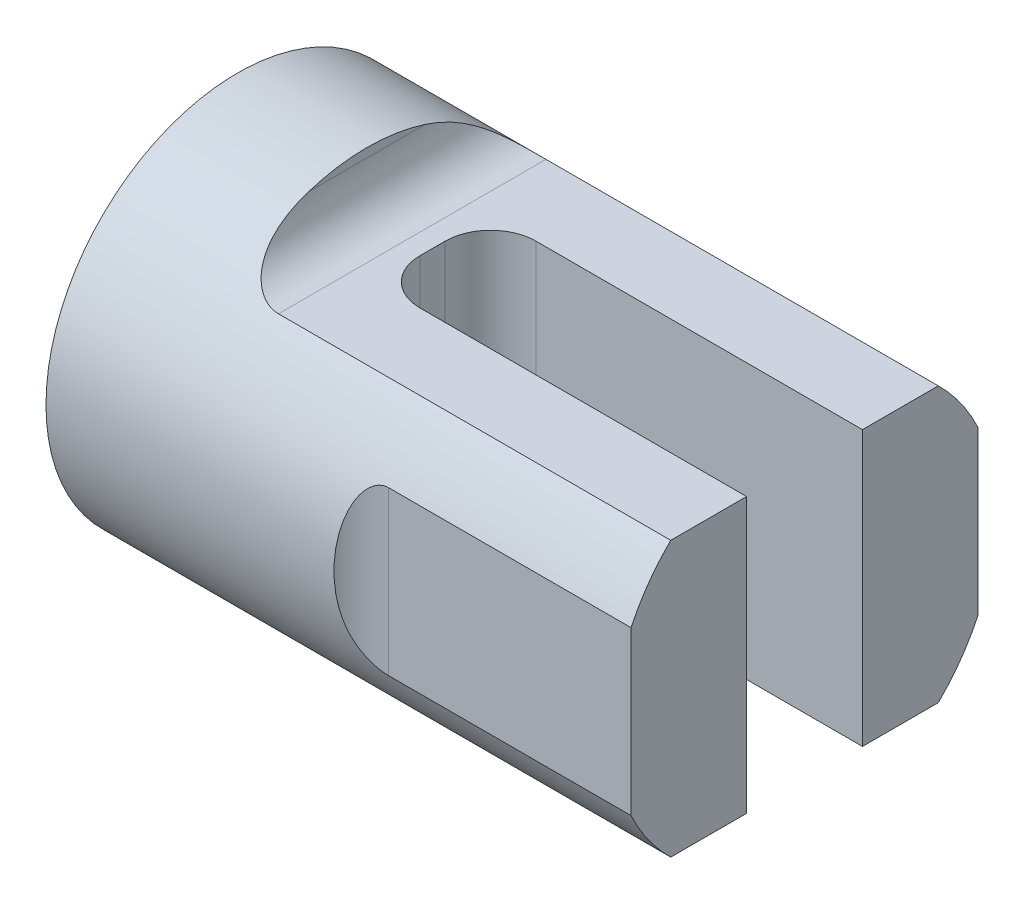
from build123d import *

# Parameters (mm, degrees)
SKETCH9_W          = 500
SKETCH9_H          = 169
SKETCH10_W         = 134.34389847
SKETCH10_H         = 273.93560547
SKETCH10_W_2       = 132.879632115
SKETCH10_H_2       = 224.606205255
CUT_EXTRUDE1_DEPTH = 214
SKETCH_W           = 272.886043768
SKETCH_H           = 67.302468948
SKETCH_W_2         = 265.53911182
SKETCH_H_2         = 143.789953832
CUT_EXTRUDE2_DEPTH = 386
SKETCH13_R         = 40
CUT_EXTRUDE5_DEPTH = 10000
CUT_EXTRUDE6_DEPTH = 1489.341694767
FILLET1_R          = 40


with BuildPart() as part:
    # Sketch9 → Revolve1 (revolve)
    with BuildSketch(Plane(origin=(0.610862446, 0, 0), x_dir=(1, 0, 0), z_dir=(0, 0, 1)), mode=Mode.PRIVATE) as revolve1_sk:
        with Locations((-1200.610862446, 6219.5)):
            Rectangle(SKETCH9_W, SKETCH9_H)
    revolve(revolve1_sk.sketch.rotate(Axis((-464.758389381, 6135, 0), (-1, 0, 0)), 90), axis=Axis((-464.758389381, 6135, 0), (-1, 0, 0)))

    # Sketch10 → Cut-Extrude1 (cut)
    with BuildSketch(Plane(origin=(-950, 0, 0), x_dir=(0, 0, -1), z_dir=(1, 0, 0))):
        with Locations((-220.171949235, 6127.421305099)):
            Rectangle(SKETCH10_W, SKETCH10_H)
        with Locations((219.439816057, 6136.342579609)):
            Rectangle(SKETCH10_W_2, SKETCH10_H_2)
    extrude(amount=-CUT_EXTRUDE1_DEPTH, mode=Mode.SUBTRACT)

    # Sketch → Cut-Extrude2 (cut)
    with BuildSketch(Plane(origin=(-950, 0, 0), x_dir=(0, 0, -1), z_dir=(1, 0, 0))):
        with Locations((6.822298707, 6289.651234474)):
            Rectangle(SKETCH_W, SKETCH_H)
        with Locations((3.148832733, 5942.105023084)):
            Rectangle(SKETCH_W_2, SKETCH_H_2)
    extrude(amount=-CUT_EXTRUDE2_DEPTH, mode=Mode.SUBTRACT)

    # Sketch13 → Cut-Extrude5 (cut)
    with BuildSketch(Plane(origin=(0, 0, 0), x_dir=(1, 0, 0), z_dir=(0, 1, 0))):
        with Locations((-1164, 193)):
            Circle(SKETCH13_R)
        with Locations((-1164, -193)):
            Circle(SKETCH13_R)
    extrude(amount=CUT_EXTRUDE5_DEPTH, mode=Mode.SUBTRACT)

    # Sketch14 → Cut-Extrude6 (cut, through all)
    with BuildSketch(Plane(origin=(0, 6256, 0), x_dir=(-1, 0, 0), z_dir=(0, 1, 0))):
        with BuildLine():
            Line((912.833335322, -51.1), (1238, -51.1))
            ThreePointArc((1238, -51.1), (1266.284271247, -39.384271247), (1278, -11.1))
            Line((1278, -11.1), (1278, 11.1))
            ThreePointArc((1278, 11.1), (1266.284271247, 39.384271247), (1238, 51.1))
            Line((1238, 51.1), (896.114155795, 51.1))
            Line((896.114155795, 51.1), (912.833335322, -51.1))
        make_face()
    extrude(amount=-CUT_EXTRUDE6_DEPTH, mode=Mode.SUBTRACT)

    # Fillet1
    fillet1_edges = [part.edges().sort_by_distance(p)[0] for p in [
        (-1336, 6256, 0),
        (-1336, 6014, 0),
    ]]
    fillet(fillet1_edges, radius=FILLET1_R)


solid = part.part
